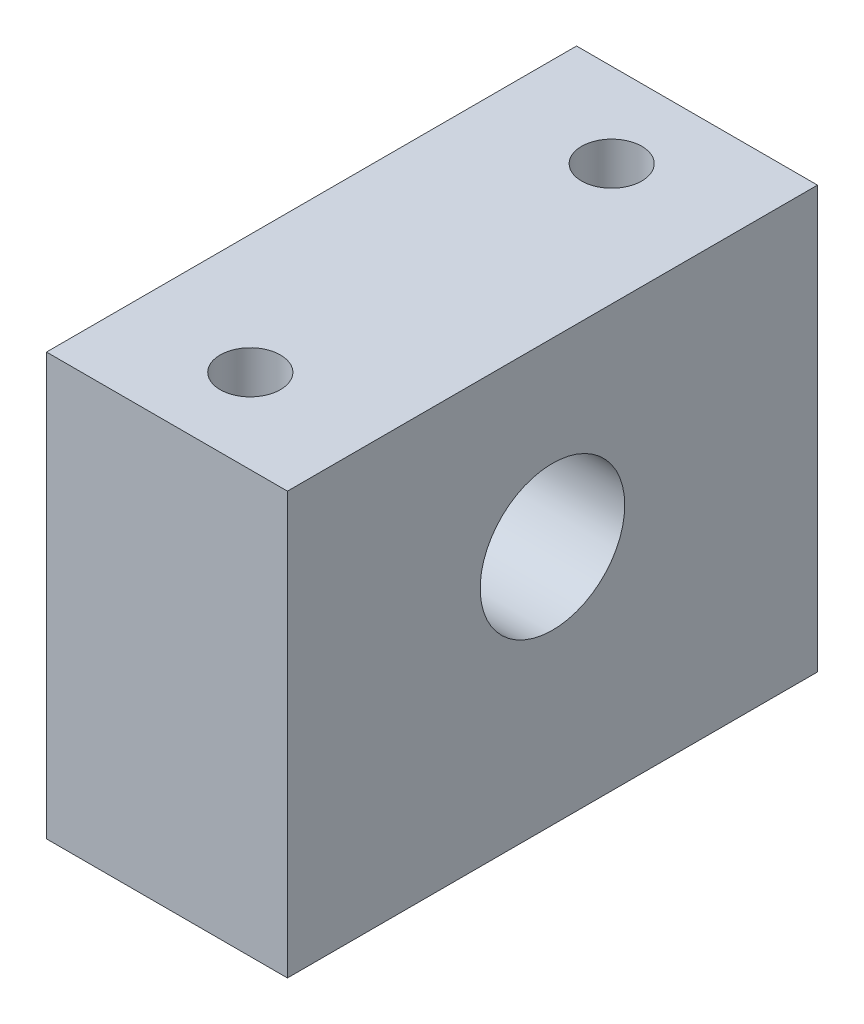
from build123d import *

# Parameters (mm, degrees)
ESQUISSE1_W             = 20
ESQUISSE1_H             = 35
BASE_EXTRUSION_DEPTH    = 44
ESQUISSE2_R             = 6
ENL_V_MAT_EXTRU_1_DEPTH = 44
TROU_TARAUD_M6X1_01_D   = 5


with BuildPart() as part:
    # Esquisse1 → Base-Extrusion (new body)
    with BuildSketch(Plane.XY):
        with Locations((-29.472022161, -21.074930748)):
            Rectangle(ESQUISSE1_W, ESQUISSE1_H)
    extrude(amount=BASE_EXTRUSION_DEPTH)

    # Esquisse2 → Enl_v. mat.-Extru.1 (cut)
    with BuildSketch(Plane(origin=(-19.472022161, 0, 0), x_dir=(0, 0, -1), z_dir=(1, 0, 0))):
        with Locations((-22, -18.574930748)):
            Circle(ESQUISSE2_R)
    extrude(amount=-ENL_V_MAT_EXTRU_1_DEPTH, mode=Mode.SUBTRACT)

    # Trou taraud_ M6x1.01 (through all)
    with Locations(Plane.XZ.offset(38.574930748)):
        with Locations((-29.555746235, 37), (-29.555746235, 7)):
            Hole(TROU_TARAUD_M6X1_01_D / 2)


solid = part.part
